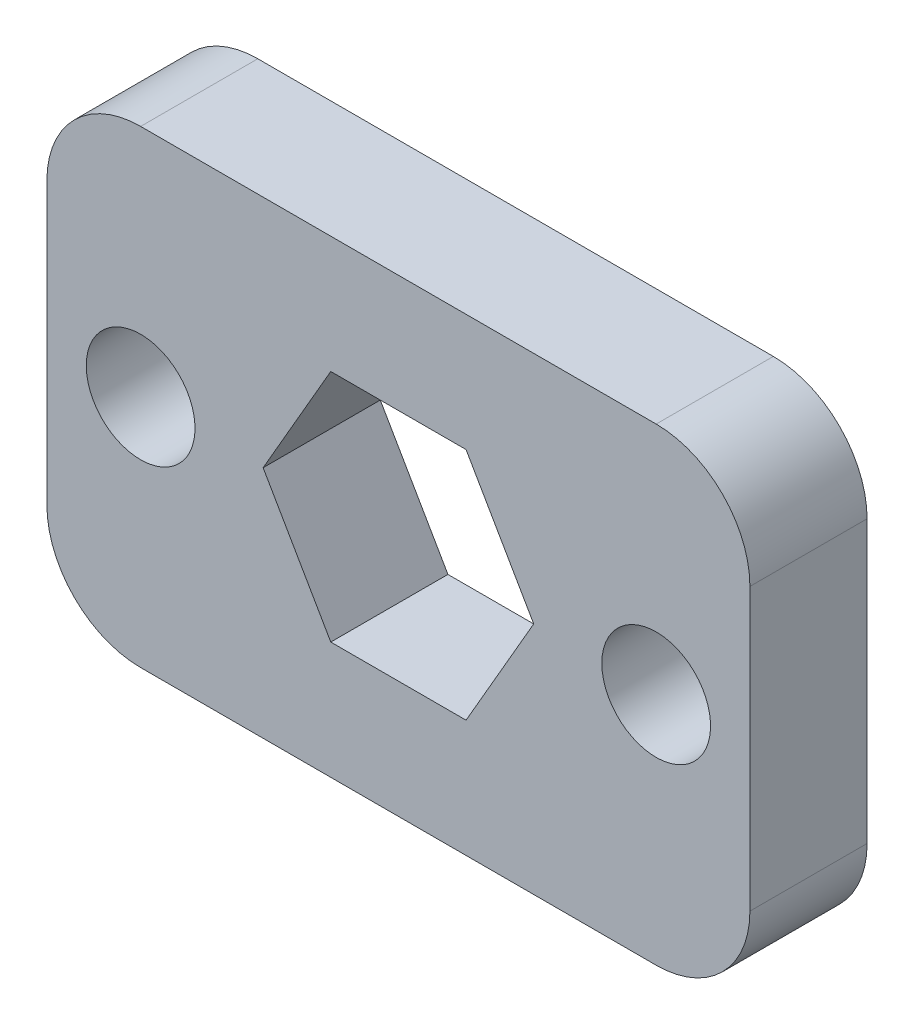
from build123d import *

# Parameters (mm, degrees)
SKETCH1_W             = 19.05
SKETCH1_H             = 12.7
BOSS_EXTRUDE1_DEPTH   = 3.175
F_4_CLEARANCE_HOLE1_D = 2.9464
FILLET1_R             = 2.54


with BuildPart() as part:
    # Sketch1 → Boss-Extrude1 (new body)
    with BuildSketch(Plane(origin=(0, 0, 0), x_dir=(-1, 0, 0), z_dir=(0, 0, -1))):
        with Locations((9.525, 6.35)):
            Rectangle(SKETCH1_W, SKETCH1_H)
        Polygon((13.191174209, 6.35), (11.358087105, 9.525), (7.691912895, 9.525), (5.858825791, 6.35), (7.691912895, 3.175), (11.358087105, 3.175), align=None, mode=Mode.SUBTRACT)
    extrude(amount=BOSS_EXTRUDE1_DEPTH)

    # 4 Clearance Hole1 (through all)
    with Locations(Plane(origin=(0, 0, -3.175), x_dir=(-1, 0, 0), z_dir=(0, 0, -1))):
        with Locations((2.54, 6.35), (16.51, 6.35)):
            Hole(F_4_CLEARANCE_HOLE1_D / 2)

    # Fillet1
    fillet1_edges = [part.edges().sort_by_distance(p)[0] for p in [
        (0, 12.7, -1.5875),
        (-19.05, 12.7, -1.5875),
        (-19.05, 0, -1.5875),
        (0, 0, -1.5875),
    ]]
    fillet(fillet1_edges, radius=FILLET1_R)


solid = part.part
